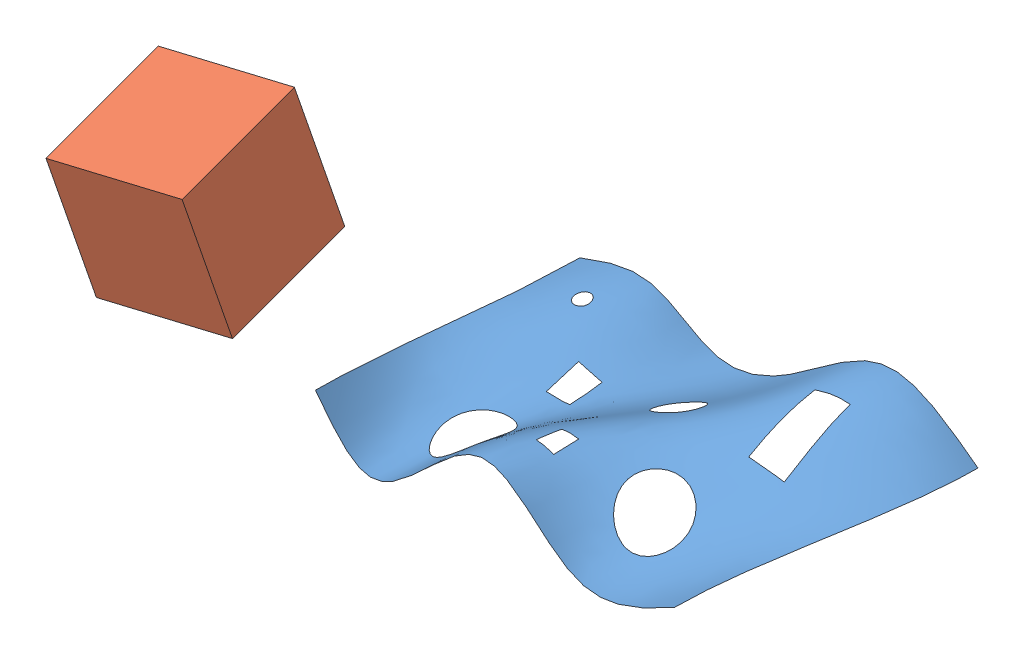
SolidWorks assembly Surfacing_Intro.SLDASM, configuration Default (file format 4700). Lengths in mm.
Overall size (471.93 132.02 158.84).
2 component instances, 2 part files, 0 mates.
Components (placement in the parent):
- Surfaces - Delete Hole-1: Surfaces - Delete Hole.SLDPRT [Default] at (-11.3136 -50.9186 40.5634) size (243.13 64.35 146.03)
- IntroCube-1: IntroCube.SLDPRT [Default] at (-300.7137 -88.5675 -70.0506) x (0.980938 0.181994 -0.068111) z (0.106508 -0.210376 0.971801) size (76.2 76.2 76.2)
